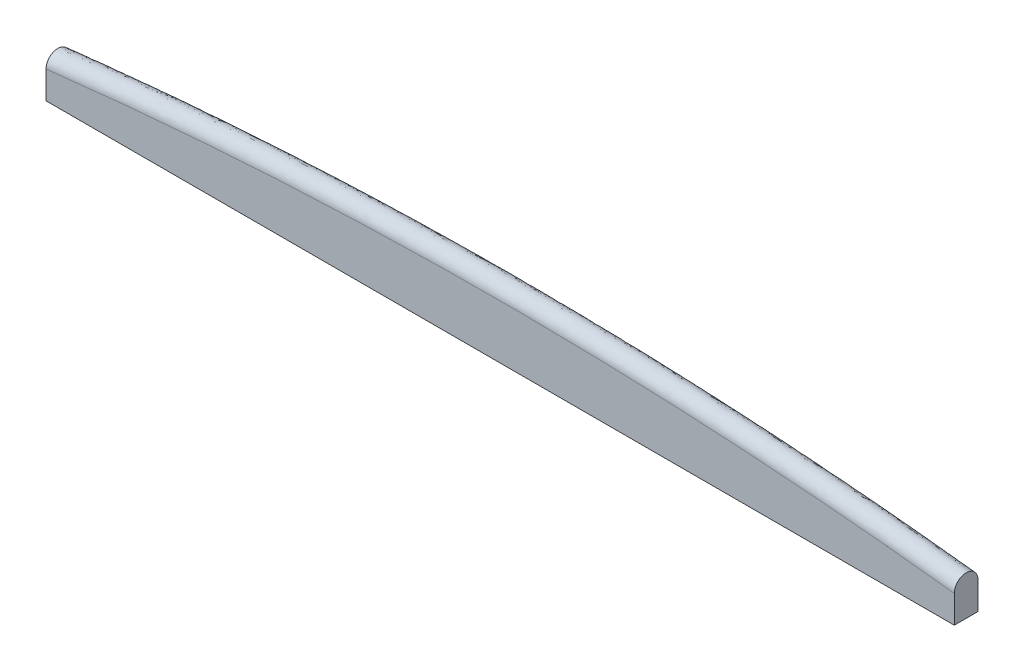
ISO-10303-21;
HEADER;
FILE_DESCRIPTION(('STEP AP214'),'2;1');
FILE_NAME('part.step','',(''),(''),'','','');
FILE_SCHEMA(('AUTOMOTIVE_DESIGN { 1 0 10303 214 1 1 1 1 }'));
ENDSEC;
DATA;
#1=APPLICATION_CONTEXT('core data for automotive mechanical design processes');
#2=APPLICATION_PROTOCOL_DEFINITION('international standard','automotive_design',2000,#1);
#3=PRODUCT_CONTEXT('',#1,'mechanical');
#4=PRODUCT('Part','Part','',(#3));
#5=PRODUCT_RELATED_PRODUCT_CATEGORY('part','',(#4));
#6=PRODUCT_DEFINITION_FORMATION('','',#4);
#7=PRODUCT_DEFINITION_CONTEXT('part definition',#1,'design');
#8=PRODUCT_DEFINITION('design','',#6,#7);
#9=PRODUCT_DEFINITION_SHAPE('','',#8);
#10=(LENGTH_UNIT() NAMED_UNIT(*) SI_UNIT(.MILLI.,.METRE.));
#11=(NAMED_UNIT(*) PLANE_ANGLE_UNIT() SI_UNIT($,.RADIAN.));
#12=(NAMED_UNIT(*) SI_UNIT($,.STERADIAN.) SOLID_ANGLE_UNIT());
#13=UNCERTAINTY_MEASURE_WITH_UNIT(LENGTH_MEASURE(1.E-05),#10,'distance_accuracy_value','');
#14=(GEOMETRIC_REPRESENTATION_CONTEXT(3) GLOBAL_UNCERTAINTY_ASSIGNED_CONTEXT((#13)) GLOBAL_UNIT_ASSIGNED_CONTEXT((#10,
#11,#12)) REPRESENTATION_CONTEXT('',''));
#15=CARTESIAN_POINT('',(0.,0.,0.));
#16=DIRECTION('',(0.,0.,1.));
#17=DIRECTION('',(1.,0.,0.));
#18=AXIS2_PLACEMENT_3D('',#15,#16,#17);
#19=CARTESIAN_POINT('',(35.0360572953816,1.02800792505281,0.762));
#20=CARTESIAN_POINT('',(33.0966421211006,1.29879608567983,0.762));
#21=CARTESIAN_POINT('',(31.15462227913,1.54708569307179,0.762));
#22=CARTESIAN_POINT('',(29.180790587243,1.77628711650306,0.762));
#23=CARTESIAN_POINT('',(29.1515365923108,1.77967893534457,0.762));
#24=CARTESIAN_POINT('',(24.2825245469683,2.3433550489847,0.762));
#25=CARTESIAN_POINT('',(19.4414425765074,2.76264308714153,0.762));
#26=CARTESIAN_POINT('',(9.72870272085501,3.3229719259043,0.762));
#27=CARTESIAN_POINT('',(4.86435346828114,3.46316512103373,0.762));
#28=CARTESIAN_POINT('',(-4.86435346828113,3.46316512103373,0.762));
#29=CARTESIAN_POINT('',(-9.72870272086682,3.32297192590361,0.762));
#30=CARTESIAN_POINT('',(-19.4414425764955,2.76264308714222,0.762));
#31=CARTESIAN_POINT('',(-24.2825245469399,2.34335504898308,0.762));
#32=CARTESIAN_POINT('',(-29.1515365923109,1.77967893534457,0.762));
#33=CARTESIAN_POINT('',(-29.180790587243,1.77628711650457,0.762));
#34=CARTESIAN_POINT('',(-31.1546222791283,1.54708569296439,0.762));
#35=CARTESIAN_POINT('',(-33.0966421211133,1.29879608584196,0.762));
#36=CARTESIAN_POINT('',(-35.0360572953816,1.02800792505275,0.762));
#37=CARTESIAN_POINT('',(35.0944772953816,1.53263759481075,0.762000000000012));
#38=CARTESIAN_POINT('',(33.1550621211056,1.80342575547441,0.762000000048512));
#39=CARTESIAN_POINT('',(31.2130422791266,2.05171536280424,0.761999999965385));
#40=CARTESIAN_POINT('',(29.239210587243,2.28091678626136,0.762000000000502));
#41=CARTESIAN_POINT('',(29.2099859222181,2.28430520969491,0.7620000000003));
#42=CARTESIAN_POINT('',(24.336077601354,2.84854814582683,0.76199999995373));
#43=CARTESIAN_POINT('',(19.4803924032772,3.26924158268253,0.761999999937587));
#44=CARTESIAN_POINT('',(9.74817844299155,3.83069214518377,0.762000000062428));
#45=CARTESIAN_POINT('',(4.874091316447,3.97116512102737,0.76199999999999));
#46=CARTESIAN_POINT('',(-4.874091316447,3.97116512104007,0.76199999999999));
#47=CARTESIAN_POINT('',(-9.74817844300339,3.83069214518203,0.762000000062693));
#48=CARTESIAN_POINT('',(-19.4803924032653,3.26924158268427,0.761999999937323));
#49=CARTESIAN_POINT('',(-24.3360776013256,2.84854814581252,0.761999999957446));
#50=CARTESIAN_POINT('',(-29.2099859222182,2.28430520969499,0.762000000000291));
#51=CARTESIAN_POINT('',(-29.2392105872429,2.28091678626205,0.761999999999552));
#52=CARTESIAN_POINT('',(-31.2130422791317,2.0517153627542,0.762000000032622));
#53=CARTESIAN_POINT('',(-33.1550621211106,1.80342575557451,0.761999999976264));
#54=CARTESIAN_POINT('',(-35.0944772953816,1.53263759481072,0.762000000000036));
#55=CARTESIAN_POINT('',(35.1675022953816,2.16342468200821,0.381000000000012));
#56=CARTESIAN_POINT('',(33.2280871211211,2.43421284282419,0.381000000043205));
#57=CARTESIAN_POINT('',(31.2860672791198,2.68250244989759,0.380999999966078));
#58=CARTESIAN_POINT('',(29.3122355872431,2.91170387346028,0.381000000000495));
#59=CARTESIAN_POINT('',(29.2830475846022,2.91508805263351,0.381000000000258));
#60=CARTESIAN_POINT('',(24.4030189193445,3.48003951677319,0.380999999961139));
#61=CARTESIAN_POINT('',(19.5290796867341,3.90248970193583,0.380999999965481));
#62=CARTESIAN_POINT('',(9.77252309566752,4.46534241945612,0.381000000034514));
#63=CARTESIAN_POINT('',(4.88626362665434,4.60616512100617,0.381000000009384));
#64=CARTESIAN_POINT('',(-4.88626362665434,4.60616512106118,0.380999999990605));
#65=CARTESIAN_POINT('',(-9.77252309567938,4.4653424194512,0.381000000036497));
#66=CARTESIAN_POINT('',(-19.5290796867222,3.90248970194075,0.380999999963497));
#67=CARTESIAN_POINT('',(-24.4030189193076,3.48003951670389,0.38099999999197));
#68=CARTESIAN_POINT('',(-29.2830475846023,2.91508805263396,0.381000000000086));
#69=CARTESIAN_POINT('',(-29.3122355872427,2.91170387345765,0.380999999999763));
#70=CARTESIAN_POINT('',(-31.2860672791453,2.68250245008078,0.381000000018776));
#71=CARTESIAN_POINT('',(-33.2280871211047,2.43421284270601,0.38099999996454));
#72=CARTESIAN_POINT('',(-35.1675022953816,2.16342468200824,0.38100000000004));
#73=CARTESIAN_POINT('',(35.1675022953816,2.16342468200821,-0.381000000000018));
#74=CARTESIAN_POINT('',(33.2280871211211,2.4342128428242,-0.381000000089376));
#75=CARTESIAN_POINT('',(31.2860672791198,2.68250244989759,-0.380999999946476));
#76=CARTESIAN_POINT('',(29.3122355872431,2.91170387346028,-0.381000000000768));
#77=CARTESIAN_POINT('',(29.2830475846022,2.91508805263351,-0.381000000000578));
#78=CARTESIAN_POINT('',(24.4030189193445,3.48003951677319,-0.380999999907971));
#79=CARTESIAN_POINT('',(19.5290796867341,3.90248970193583,-0.380999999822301));
#80=CARTESIAN_POINT('',(9.77252309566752,4.46534241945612,-0.381000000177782));
#81=CARTESIAN_POINT('',(4.88626362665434,4.60616512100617,-0.380999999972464));
#82=CARTESIAN_POINT('',(-4.88626362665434,4.60616512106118,-0.381000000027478));
#83=CARTESIAN_POINT('',(-9.77252309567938,4.4653424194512,-0.381000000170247));
#84=CARTESIAN_POINT('',(-19.5290796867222,3.90248970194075,-0.380999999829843));
#85=CARTESIAN_POINT('',(-24.4030189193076,3.48003951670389,-0.380999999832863));
#86=CARTESIAN_POINT('',(-29.2830475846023,2.91508805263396,-0.381000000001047));
#87=CARTESIAN_POINT('',(-29.3122355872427,2.91170387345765,-0.380999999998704));
#88=CARTESIAN_POINT('',(-31.2860672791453,2.68250245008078,-0.381000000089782));
#89=CARTESIAN_POINT('',(-33.2280871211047,2.43421284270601,-0.380999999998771));
#90=CARTESIAN_POINT('',(-35.1675022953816,2.16342468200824,-0.381000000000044));
#91=CARTESIAN_POINT('',(35.0944772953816,1.53263759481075,-0.762000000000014));
#92=CARTESIAN_POINT('',(33.1550621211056,1.80342575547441,-0.762000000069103));
#93=CARTESIAN_POINT('',(31.2130422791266,2.05171536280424,-0.761999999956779));
#94=CARTESIAN_POINT('',(29.239210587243,2.28091678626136,-0.762000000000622));
#95=CARTESIAN_POINT('',(29.2099859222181,2.28430520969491,-0.762000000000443));
#96=CARTESIAN_POINT('',(24.336077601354,2.84854814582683,-0.761999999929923));
#97=CARTESIAN_POINT('',(19.4803924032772,3.26924158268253,-0.761999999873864));
#98=CARTESIAN_POINT('',(9.74817844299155,3.83069214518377,-0.762000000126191));
#99=CARTESIAN_POINT('',(4.874091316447,3.97116512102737,-0.761999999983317));
#100=CARTESIAN_POINT('',(-4.874091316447,3.97116512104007,-0.762000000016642));
#101=CARTESIAN_POINT('',(-9.74817844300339,3.83069214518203,-0.762000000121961));
#102=CARTESIAN_POINT('',(-19.4803924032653,3.26924158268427,-0.761999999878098));
#103=CARTESIAN_POINT('',(-24.3360776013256,2.84854814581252,-0.76199999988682));
#104=CARTESIAN_POINT('',(-29.2099859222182,2.28430520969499,-0.762000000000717));
#105=CARTESIAN_POINT('',(-29.2392105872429,2.28091678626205,-0.761999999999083));
#106=CARTESIAN_POINT('',(-31.2130422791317,2.0517153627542,-0.762000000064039));
#107=CARTESIAN_POINT('',(-33.1550621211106,1.80342575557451,-0.76199999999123));
#108=CARTESIAN_POINT('',(-35.0944772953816,1.53263759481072,-0.762000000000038));
#109=CARTESIAN_POINT('',(35.0360572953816,1.02800792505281,-0.762));
#110=CARTESIAN_POINT('',(33.0966421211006,1.29879608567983,-0.762));
#111=CARTESIAN_POINT('',(31.15462227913,1.54708569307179,-0.762));
#112=CARTESIAN_POINT('',(29.180790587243,1.77628711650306,-0.762));
#113=CARTESIAN_POINT('',(29.1515365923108,1.77967893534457,-0.762));
#114=CARTESIAN_POINT('',(24.2825245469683,2.3433550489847,-0.762));
#115=CARTESIAN_POINT('',(19.4414425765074,2.76264308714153,-0.762));
#116=CARTESIAN_POINT('',(9.72870272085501,3.3229719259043,-0.762));
#117=CARTESIAN_POINT('',(4.86435346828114,3.46316512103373,-0.762));
#118=CARTESIAN_POINT('',(-4.86435346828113,3.46316512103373,-0.762));
#119=CARTESIAN_POINT('',(-9.72870272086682,3.32297192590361,-0.762));
#120=CARTESIAN_POINT('',(-19.4414425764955,2.76264308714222,-0.762));
#121=CARTESIAN_POINT('',(-24.2825245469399,2.34335504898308,-0.762));
#122=CARTESIAN_POINT('',(-29.1515365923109,1.77967893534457,-0.762));
#123=CARTESIAN_POINT('',(-29.180790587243,1.77628711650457,-0.762));
#124=CARTESIAN_POINT('',(-31.1546222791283,1.54708569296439,-0.762));
#125=CARTESIAN_POINT('',(-33.0966421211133,1.29879608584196,-0.762));
#126=CARTESIAN_POINT('',(-35.0360572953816,1.02800792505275,-0.762));
#127=(BOUNDED_SURFACE() B_SPLINE_SURFACE(5,3,((#19,#20,#21,#22,#23,#24,#25,#26,#27,#28,#29,#30,
#31,#32,#33,#34,#35,#36),(#37,#38,#39,#40,#41,#42,#43,#44,#45,#46,#47,#48,#49,#50,#51,#52,#53,
#54),(#55,#56,#57,#58,#59,#60,#61,#62,#63,#64,#65,#66,#67,#68,#69,#70,#71,#72),(#73,#74,#75,#76,
#77,#78,#79,#80,#81,#82,#83,#84,#85,#86,#87,#88,#89,#90),(#91,#92,#93,#94,#95,#96,#97,#98,#99,
#100,#101,#102,#103,#104,#105,#106,#107,#108),(#109,#110,#111,#112,#113,#114,#115,#116,#117,
#118,#119,#120,#121,#122,#123,#124,#125,#126)),.UNSPECIFIED.,.F.,.F.,
.F.) B_SPLINE_SURFACE_WITH_KNOTS((6,6),(4,2,2,2,2,2,2,2,4),(0.,1.),(-0.101807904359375,
-0.00150658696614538,0.,0.25,0.5,0.75,1.,1.00150658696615,1.10180790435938),
.UNSPECIFIED.) GEOMETRIC_REPRESENTATION_ITEM() RATIONAL_B_SPLINE_SURFACE(((1.,1.,1.,1.,1.,1.,1.,
1.,1.,1.,1.,1.,1.,1.,1.,1.,1.,1.),(0.59999999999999,0.59999999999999,0.600000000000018,
0.600000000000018,0.599999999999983,0.599999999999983,0.599999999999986,0.599999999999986,
0.600000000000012,0.600000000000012,0.599999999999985,0.599999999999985,0.599999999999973,
0.599999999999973,0.599999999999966,0.599999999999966,0.599999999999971,0.599999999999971),
(0.399999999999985,0.399999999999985,0.400000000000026,0.400000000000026,0.399999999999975,
0.399999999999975,0.399999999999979,0.399999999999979,0.400000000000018,0.400000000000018,
0.399999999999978,0.399999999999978,0.39999999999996,0.39999999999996,0.399999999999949,
0.399999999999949,0.399999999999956,0.399999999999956),(0.399999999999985,0.399999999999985,
0.400000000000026,0.400000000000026,0.399999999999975,0.399999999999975,0.399999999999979,
0.399999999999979,0.400000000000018,0.400000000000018,0.399999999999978,0.399999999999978,
0.39999999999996,0.39999999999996,0.399999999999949,0.399999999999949,0.399999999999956,
0.399999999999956),(0.59999999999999,0.59999999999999,0.600000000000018,0.600000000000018,
0.599999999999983,0.599999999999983,0.599999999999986,0.599999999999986,0.600000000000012,
0.600000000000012,0.599999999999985,0.599999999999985,0.599999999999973,0.599999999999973,
0.599999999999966,0.599999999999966,0.599999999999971,0.599999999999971),(1.,1.,1.,1.,1.,1.,1.,
1.,1.,1.,1.,1.,1.,1.,1.,1.,1.,1.))) REPRESENTATION_ITEM('') SURFACE());
#128=CARTESIAN_POINT('',(-35.0360572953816,1.02800792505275,0.762));
#129=CARTESIAN_POINT('',(-33.0966421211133,1.29879608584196,0.762));
#130=CARTESIAN_POINT('',(-31.1546222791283,1.54708569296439,0.762));
#131=CARTESIAN_POINT('',(-29.180790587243,1.77628711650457,0.762));
#132=CARTESIAN_POINT('',(-29.1515365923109,1.77967893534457,0.762));
#133=CARTESIAN_POINT('',(-24.2825245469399,2.34335504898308,0.762));
#134=CARTESIAN_POINT('',(-19.4414425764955,2.76264308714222,0.762));
#135=CARTESIAN_POINT('',(-9.72870272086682,3.32297192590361,0.762));
#136=CARTESIAN_POINT('',(-4.86435346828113,3.46316512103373,0.762));
#137=CARTESIAN_POINT('',(4.86435346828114,3.46316512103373,0.762));
#138=CARTESIAN_POINT('',(9.72870272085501,3.3229719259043,0.762));
#139=CARTESIAN_POINT('',(19.4414425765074,2.76264308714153,0.762));
#140=CARTESIAN_POINT('',(24.2825245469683,2.3433550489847,0.762));
#141=CARTESIAN_POINT('',(29.1515365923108,1.77967893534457,0.762));
#142=CARTESIAN_POINT('',(29.180790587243,1.77628711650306,0.762));
#143=CARTESIAN_POINT('',(31.15462227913,1.54708569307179,0.762));
#144=CARTESIAN_POINT('',(33.0966421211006,1.29879608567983,0.762));
#145=CARTESIAN_POINT('',(35.0360572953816,1.02800792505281,0.762));
#146=(BOUNDED_CURVE() B_SPLINE_CURVE(3,(#128,#129,#130,#131,#132,#133,#134,#135,#136,#137,#138,
#139,#140,#141,#142,#143,#144,#145),.UNSPECIFIED.,.F.,.F.) B_SPLINE_CURVE_WITH_KNOTS((4,2,2,2,2,
2,2,2,4),(-0.101807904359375,-0.00150658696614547,0.,0.250000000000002,0.500000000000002,
0.750000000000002,1.,1.00150658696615,1.10180790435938),
.UNSPECIFIED.) CURVE() GEOMETRIC_REPRESENTATION_ITEM() RATIONAL_B_SPLINE_CURVE((1.,1.,1.,1.,1.,
1.,1.,1.,1.,1.,1.,1.,1.,1.,1.,1.,1.,1.)) REPRESENTATION_ITEM(''));
#147=CARTESIAN_POINT('',(29.21,1.7728953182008,0.762));
#148=VERTEX_POINT('',#147);
#149=CARTESIAN_POINT('',(-29.21,1.77289531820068,0.762));
#150=VERTEX_POINT('',#149);
#151=EDGE_CURVE('E81',#148,#150,#146,.F.);
#152=CARTESIAN_POINT('',(29.21,1.77289531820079,0.762));
#153=CARTESIAN_POINT('',(29.2099460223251,1.77545632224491,0.761999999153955));
#154=CARTESIAN_POINT('',(29.2098920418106,1.77801737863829,0.761987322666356));
#155=CARTESIAN_POINT('',(29.2096849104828,1.78792696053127,0.761889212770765));
#156=CARTESIAN_POINT('',(29.209535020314,1.79527487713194,0.76171206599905));
#157=CARTESIAN_POINT('',(29.2092966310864,1.80819902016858,0.761216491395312));
#158=CARTESIAN_POINT('',(29.2092020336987,1.81377690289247,0.760942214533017));
#159=CARTESIAN_POINT('',(29.2090041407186,1.82629231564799,0.760191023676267));
#160=CARTESIAN_POINT('',(29.2089043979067,1.83322794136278,0.759680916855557));
#161=CARTESIAN_POINT('',(29.2087057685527,1.84854332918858,0.758346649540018));
#162=CARTESIAN_POINT('',(29.2086114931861,1.85691937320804,0.75747895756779));
#163=CARTESIAN_POINT('',(29.2084335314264,1.87521169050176,0.75528127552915));
#164=CARTESIAN_POINT('',(29.2083551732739,1.88512129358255,0.753895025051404));
#165=CARTESIAN_POINT('',(29.2082199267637,1.90658366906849,0.750465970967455));
#166=CARTESIAN_POINT('',(29.2081690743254,1.91812498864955,0.748351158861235));
#167=CARTESIAN_POINT('',(29.208099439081,1.94295421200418,0.743212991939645));
#168=CARTESIAN_POINT('',(29.2080871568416,1.95622337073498,0.740098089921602));
#169=CARTESIAN_POINT('',(29.208099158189,1.97673219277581,0.734705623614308));
#170=CARTESIAN_POINT('',(29.2081096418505,1.98403626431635,0.732669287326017));
#171=CARTESIAN_POINT('',(29.2081424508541,1.99910725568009,0.728226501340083));
#172=CARTESIAN_POINT('',(29.2081655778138,2.00686944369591,0.725803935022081));
#173=CARTESIAN_POINT('',(29.2082241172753,2.02286091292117,0.720533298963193));
#174=CARTESIAN_POINT('',(29.2082602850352,2.03108425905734,0.717667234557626));
#175=CARTESIAN_POINT('',(29.2083448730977,2.04799850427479,0.711447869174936));
#176=CARTESIAN_POINT('',(29.2083939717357,2.05668203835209,0.708074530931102));
#177=CARTESIAN_POINT('',(29.2085037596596,2.07451155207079,0.700772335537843));
#178=CARTESIAN_POINT('',(29.2085650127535,2.08364842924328,0.696821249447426));
#179=CARTESIAN_POINT('',(29.2086976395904,2.10237254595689,0.688288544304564));
#180=CARTESIAN_POINT('',(29.2087694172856,2.11194860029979,0.683682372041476));
#181=CARTESIAN_POINT('',(29.2089206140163,2.13153014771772,0.673757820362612));
#182=CARTESIAN_POINT('',(29.2090002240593,2.14152197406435,0.66841246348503));
#183=CARTESIAN_POINT('',(29.2091633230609,2.16190322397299,0.656921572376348));
#184=CARTESIAN_POINT('',(29.2092467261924,2.17227605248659,0.650746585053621));
#185=CARTESIAN_POINT('',(29.2094122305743,2.19337414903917,0.637502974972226));
#186=CARTESIAN_POINT('',(29.2094939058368,2.20407940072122,0.630402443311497));
#187=CARTESIAN_POINT('',(29.2096485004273,2.22578140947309,0.615210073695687));
#188=CARTESIAN_POINT('',(29.2097205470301,2.23675421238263,0.607083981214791));
#189=CARTESIAN_POINT('',(29.2098481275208,2.25891135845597,0.589740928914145));
#190=CARTESIAN_POINT('',(29.2099023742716,2.27006724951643,0.58048761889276));
#191=CARTESIAN_POINT('',(29.2099766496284,2.29249097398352,0.560790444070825));
#192=CARTESIAN_POINT('',(29.2099944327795,2.30372545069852,0.550308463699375));
#193=CARTESIAN_POINT('',(29.2100023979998,2.31933169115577,0.534844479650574));
#194=CARTESIAN_POINT('',(29.2100025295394,2.32396948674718,0.530128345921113));
#195=CARTESIAN_POINT('',(29.2100080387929,2.33312498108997,0.520572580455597));
#196=CARTESIAN_POINT('',(29.2100134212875,2.33764256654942,0.515732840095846));
#197=CARTESIAN_POINT('',(29.2100326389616,2.3510078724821,0.501035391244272));
#198=CARTESIAN_POINT('',(29.2100495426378,2.35966469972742,0.491002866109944));
#199=CARTESIAN_POINT('',(29.2100889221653,2.37643548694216,0.47051051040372));
#200=CARTESIAN_POINT('',(29.2101113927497,2.38454995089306,0.460051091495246));
#201=CARTESIAN_POINT('',(29.2101573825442,2.4002012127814,0.438753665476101));
#202=CARTESIAN_POINT('',(29.2101808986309,2.40773956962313,0.427916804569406));
#203=CARTESIAN_POINT('',(29.2102258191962,2.42220897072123,0.405917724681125));
#204=CARTESIAN_POINT('',(29.2102472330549,2.42914269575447,0.394757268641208));
#205=CARTESIAN_POINT('',(29.2102853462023,2.4423797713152,0.372166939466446));
#206=CARTESIAN_POINT('',(29.2103020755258,2.44868696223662,0.360739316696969));
#207=CARTESIAN_POINT('',(29.2103290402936,2.46065454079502,0.337672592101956));
#208=CARTESIAN_POINT('',(29.2103393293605,2.46631993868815,0.326036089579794));
#209=CARTESIAN_POINT('',(29.210352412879,2.4769943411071,0.302610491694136));
#210=CARTESIAN_POINT('',(29.210355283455,2.48200950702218,0.290824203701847));
#211=CARTESIAN_POINT('',(29.2103533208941,2.49138064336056,0.267157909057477));
#212=CARTESIAN_POINT('',(29.2103485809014,2.49574388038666,0.255280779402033));
#213=CARTESIAN_POINT('',(29.2103319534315,2.50381495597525,0.231490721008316));
#214=CARTESIAN_POINT('',(29.2103201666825,2.50753109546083,0.219580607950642));
#215=CARTESIAN_POINT('',(29.2102907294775,2.51431803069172,0.195780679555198));
#216=CARTESIAN_POINT('',(29.2102731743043,2.51739806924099,0.183893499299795));
#217=CARTESIAN_POINT('',(29.2102341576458,2.52292864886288,0.160192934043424));
#218=CARTESIAN_POINT('',(29.2102127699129,2.52538926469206,0.148381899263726));
#219=CARTESIAN_POINT('',(29.2101686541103,2.52970206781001,0.124883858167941));
#220=CARTESIAN_POINT('',(29.2101459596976,2.53156503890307,0.11319883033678));
#221=CARTESIAN_POINT('',(29.2101023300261,2.53470819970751,0.0899992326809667));
#222=CARTESIAN_POINT('',(29.2100813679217,2.53599975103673,0.0784862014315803));
#223=CARTESIAN_POINT('',(29.2100447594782,2.53802960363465,0.0556728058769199));
#224=CARTESIAN_POINT('',(29.210029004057,2.53877970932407,0.0443734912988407));
#225=CARTESIAN_POINT('',(29.2100067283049,2.53975937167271,0.0220252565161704));
#226=CARTESIAN_POINT('',(29.2099999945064,2.54000104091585,0.0109768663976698));
#227=CARTESIAN_POINT('',(29.210000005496,2.53999895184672,-0.0111249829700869));
#228=CARTESIAN_POINT('',(29.2100067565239,2.53975496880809,-0.0221784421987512));
#229=CARTESIAN_POINT('',(29.2100291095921,2.53877013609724,-0.0445375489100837));
#230=CARTESIAN_POINT('',(29.2100449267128,2.53801712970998,-0.0558426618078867));
#231=CARTESIAN_POINT('',(29.2100816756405,2.53598081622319,-0.0786683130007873));
#232=CARTESIAN_POINT('',(29.2101027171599,2.53468566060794,-0.0901877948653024));
#233=CARTESIAN_POINT('',(29.210146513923,2.53153451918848,-0.113400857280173));
#234=CARTESIAN_POINT('',(29.2101692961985,2.52966712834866,-0.125092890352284));
#235=CARTESIAN_POINT('',(29.2102135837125,2.52534461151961,-0.148605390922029));
#236=CARTESIAN_POINT('',(29.2102350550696,2.52287865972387,-0.160423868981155));
#237=CARTESIAN_POINT('',(29.2102742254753,2.51733644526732,-0.184139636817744));
#238=CARTESIAN_POINT('',(29.2102918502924,2.51425006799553,-0.196034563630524));
#239=CARTESIAN_POINT('',(29.2103214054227,2.50744942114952,-0.219850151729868));
#240=CARTESIAN_POINT('',(29.2103332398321,2.50372587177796,-0.231768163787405));
#241=CARTESIAN_POINT('',(29.2103499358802,2.49563889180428,-0.255574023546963));
#242=CARTESIAN_POINT('',(29.2103546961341,2.49126712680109,-0.267459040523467));
#243=CARTESIAN_POINT('',(29.2103566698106,2.48187782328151,-0.291140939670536));
#244=CARTESIAN_POINT('',(29.2103537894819,2.47685298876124,-0.302934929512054));
#245=CARTESIAN_POINT('',(29.2103406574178,2.46615813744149,-0.326375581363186));
#246=CARTESIAN_POINT('',(29.2103303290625,2.46048193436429,-0.338019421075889));
#247=CARTESIAN_POINT('',(29.2103032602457,2.44849166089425,-0.361100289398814));
#248=CARTESIAN_POINT('',(29.2102864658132,2.44217256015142,-0.372534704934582));
#249=CARTESIAN_POINT('',(29.2102482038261,2.42891063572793,-0.395137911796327));
#250=CARTESIAN_POINT('',(29.2102267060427,2.42196395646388,-0.406304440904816));
#251=CARTESIAN_POINT('',(29.2101816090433,2.40746770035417,-0.428314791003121));
#252=CARTESIAN_POINT('',(29.2101580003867,2.39991543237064,-0.439156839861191));
#253=CARTESIAN_POINT('',(29.2101118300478,2.38423551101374,-0.460463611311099));
#254=CARTESIAN_POINT('',(29.2100892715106,2.37610629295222,-0.470927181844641));
#255=CARTESIAN_POINT('',(29.2100497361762,2.35930528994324,-0.491426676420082));
#256=CARTESIAN_POINT('',(29.2100327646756,2.3506329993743,-0.501462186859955));
#257=CARTESIAN_POINT('',(29.2100134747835,2.33724406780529,-0.516163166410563));
#258=CARTESIAN_POINT('',(29.2100080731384,2.33271854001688,-0.521003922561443));
#259=CARTESIAN_POINT('',(29.2100025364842,2.3235470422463,-0.530561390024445));
#260=CARTESIAN_POINT('',(29.2100023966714,2.31890118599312,-0.535278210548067));
#261=CARTESIAN_POINT('',(29.2099944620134,2.30331931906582,-0.550693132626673));
#262=CARTESIAN_POINT('',(29.2099768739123,2.29212007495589,-0.561127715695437));
#263=CARTESIAN_POINT('',(29.2099033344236,2.26976783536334,-0.580739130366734));
#264=CARTESIAN_POINT('',(29.2098496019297,2.25864783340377,-0.5899537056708));
#265=CARTESIAN_POINT('',(29.2097232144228,2.23656225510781,-0.607227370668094));
#266=CARTESIAN_POINT('',(29.2096518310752,2.22562483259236,-0.615322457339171));
#267=CARTESIAN_POINT('',(29.2094986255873,2.20399241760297,-0.630459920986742));
#268=CARTESIAN_POINT('',(29.2094176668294,2.19332113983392,-0.637536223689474));
#269=CARTESIAN_POINT('',(29.209253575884,2.17228913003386,-0.650737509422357));
#270=CARTESIAN_POINT('',(29.2091708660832,2.16194822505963,-0.656894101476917));
#271=CARTESIAN_POINT('',(29.2090090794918,2.14162847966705,-0.6683534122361));
#272=CARTESIAN_POINT('',(29.2089300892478,2.13166608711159,-0.673685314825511));
#273=CARTESIAN_POINT('',(29.2087800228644,2.11214075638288,-0.683587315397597));
#274=CARTESIAN_POINT('',(29.2087087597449,2.10259137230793,-0.68818415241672));
#275=CARTESIAN_POINT('',(29.2085770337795,2.08391777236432,-0.696701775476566));
#276=CARTESIAN_POINT('',(29.2085161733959,2.0748046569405,-0.700646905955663));
#277=CARTESIAN_POINT('',(29.2084070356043,2.05701977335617,-0.707940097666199));
#278=CARTESIAN_POINT('',(29.2083582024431,2.04835704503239,-0.711310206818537));
#279=CARTESIAN_POINT('',(29.2082740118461,2.0314815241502,-0.717525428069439));
#280=CARTESIAN_POINT('',(29.2082379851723,2.02327605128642,-0.720390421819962));
#281=CARTESIAN_POINT('',(29.20817960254,2.00731750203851,-0.725660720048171));
#282=CARTESIAN_POINT('',(29.2081565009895,1.99957032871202,-0.728083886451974));
#283=CARTESIAN_POINT('',(29.2081236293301,1.98452663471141,-0.73252924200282));
#284=CARTESIAN_POINT('',(29.2081130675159,1.97723482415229,-0.734567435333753));
#285=CARTESIAN_POINT('',(29.2081006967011,1.95675510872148,-0.739967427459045));
#286=CARTESIAN_POINT('',(29.208112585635,1.94350274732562,-0.74308848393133));
#287=CARTESIAN_POINT('',(29.208181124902,1.91869771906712,-0.74824106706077));
#288=CARTESIAN_POINT('',(29.2082313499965,1.9071637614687,-0.750363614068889));
#289=CARTESIAN_POINT('',(29.2083651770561,1.88570771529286,-0.753808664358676));
#290=CARTESIAN_POINT('',(29.2084428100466,1.87579708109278,-0.75520282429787));
#291=CARTESIAN_POINT('',(29.2086192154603,1.8574951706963,-0.757415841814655));
#292=CARTESIAN_POINT('',(29.2087127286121,1.84911058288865,-0.758290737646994));
#293=CARTESIAN_POINT('',(29.2089099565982,1.83377125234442,-0.759638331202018));
#294=CARTESIAN_POINT('',(29.2090091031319,1.8268202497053,-0.760154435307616));
#295=CARTESIAN_POINT('',(29.2092055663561,1.81426768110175,-0.760916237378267));
#296=CARTESIAN_POINT('',(29.2092994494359,1.8086680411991,-0.76119507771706));
#297=CARTESIAN_POINT('',(29.2095375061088,1.79566033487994,-0.761701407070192));
#298=CARTESIAN_POINT('',(29.2096881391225,1.78825053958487,-0.761883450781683));
#299=CARTESIAN_POINT('',(29.2098928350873,1.7781917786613,-0.761986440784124));
#300=CARTESIAN_POINT('',(29.2099467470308,1.77554352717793,-0.761999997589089));
#301=CARTESIAN_POINT('',(29.21,1.7728953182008,-0.762));
#302=B_SPLINE_CURVE_WITH_KNOTS('',3,(#152,#153,#154,#155,#156,#157,#158,#159,#160,#161,#162,
#163,#164,#165,#166,#167,#168,#169,#170,#171,#172,#173,#174,#175,#176,#177,#178,#179,#180,#181,
#182,#183,#184,#185,#186,#187,#188,#189,#190,#191,#192,#193,#194,#195,#196,#197,#198,#199,#200,
#201,#202,#203,#204,#205,#206,#207,#208,#209,#210,#211,#212,#213,#214,#215,#216,#217,#218,#219,
#220,#221,#222,#223,#224,#225,#226,#227,#228,#229,#230,#231,#232,#233,#234,#235,#236,#237,#238,
#239,#240,#241,#242,#243,#244,#245,#246,#247,#248,#249,#250,#251,#252,#253,#254,#255,#256,#257,
#258,#259,#260,#261,#262,#263,#264,#265,#266,#267,#268,#269,#270,#271,#272,#273,#274,#275,#276,
#277,#278,#279,#280,#281,#282,#283,#284,#285,#286,#287,#288,#289,#290,#291,#292,#293,#294,#295,
#296,#297,#298,#299,#300,#301),.UNSPECIFIED.,.F.,.F.,(4,2,2,2,2,2,2,2,2,2,2,2,2,2,2,2,2,2,2,2,2,
2,2,2,2,2,2,2,2,2,2,2,2,2,2,2,2,2,2,2,2,2,2,2,2,2,2,2,2,2,2,2,2,2,2,2,2,2,2,2,2,2,2,2,2,2,2,2,2,
2,2,2,2,2,4),(0.,0.00768482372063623,0.0297361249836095,0.0464912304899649,0.0673538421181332,
0.0926135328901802,0.122625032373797,0.157813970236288,0.198682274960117,0.221427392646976,
0.245817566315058,0.271938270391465,0.2998797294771,0.329736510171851,0.361606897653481,
0.395592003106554,0.431794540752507,0.47031720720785,0.511260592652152,0.554720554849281,
0.600784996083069,0.620626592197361,0.640486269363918,0.680220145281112,0.719916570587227,
0.759501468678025,0.798900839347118,0.838041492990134,0.876851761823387,0.915262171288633,
0.953206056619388,0.990620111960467,1.02744486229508,1.06362505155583,1.09910994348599,
1.13385353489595,1.16781468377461,1.20095715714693,1.2341149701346,1.2680940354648,
1.30285804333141,1.33836575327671,1.37457104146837,1.41142302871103,1.44886629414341,
1.48684117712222,1.52528416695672,1.56412837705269,1.60330409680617,1.64273941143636,
1.68236087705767,1.72209423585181,1.76186515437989,1.78174331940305,1.80160333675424,
1.84749386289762,1.8907970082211,1.93159993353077,1.96999763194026,2.00608975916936,
2.0399780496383,2.07176425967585,2.10154857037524,2.12942838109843,2.15549742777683,
2.17984516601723,2.20255636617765,2.24337991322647,2.27855132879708,2.30856916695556,
2.33385654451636,2.35476644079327,2.37158735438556,2.39382452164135,2.40177086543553),.UNSPECIFIED.);
#303=CARTESIAN_POINT('',(29.21,1.7728953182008,-0.762));
#304=VERTEX_POINT('',#303);
#305=EDGE_CURVE('E44',#304,#148,#302,.F.);
#306=CARTESIAN_POINT('',(35.0360572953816,1.02800792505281,-0.762));
#307=CARTESIAN_POINT('',(33.0966421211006,1.29879608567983,-0.762));
#308=CARTESIAN_POINT('',(31.15462227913,1.54708569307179,-0.762));
#309=CARTESIAN_POINT('',(29.180790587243,1.77628711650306,-0.762));
#310=CARTESIAN_POINT('',(29.1515365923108,1.77967893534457,-0.762));
#311=CARTESIAN_POINT('',(24.2825245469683,2.3433550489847,-0.762));
#312=CARTESIAN_POINT('',(19.4414425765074,2.76264308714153,-0.762));
#313=CARTESIAN_POINT('',(9.72870272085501,3.3229719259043,-0.762));
#314=CARTESIAN_POINT('',(4.86435346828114,3.46316512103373,-0.762));
#315=CARTESIAN_POINT('',(-4.86435346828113,3.46316512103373,-0.762));
#316=CARTESIAN_POINT('',(-9.72870272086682,3.32297192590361,-0.762));
#317=CARTESIAN_POINT('',(-19.4414425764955,2.76264308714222,-0.762));
#318=CARTESIAN_POINT('',(-24.2825245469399,2.34335504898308,-0.762));
#319=CARTESIAN_POINT('',(-29.1515365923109,1.77967893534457,-0.762));
#320=CARTESIAN_POINT('',(-29.180790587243,1.77628711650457,-0.762));
#321=CARTESIAN_POINT('',(-31.1546222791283,1.54708569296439,-0.762));
#322=CARTESIAN_POINT('',(-33.0966421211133,1.29879608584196,-0.762));
#323=CARTESIAN_POINT('',(-35.0360572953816,1.02800792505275,-0.762));
#324=(BOUNDED_CURVE() B_SPLINE_CURVE(3,(#306,#307,#308,#309,#310,#311,#312,#313,#314,#315,#316,
#317,#318,#319,#320,#321,#322,#323),.UNSPECIFIED.,.F.,.F.) B_SPLINE_CURVE_WITH_KNOTS((4,2,2,2,2,
2,2,2,4),(-0.101807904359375,-0.00150658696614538,0.,0.25,0.5,0.75,1.,1.00150658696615,
1.10180790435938),
.UNSPECIFIED.) CURVE() GEOMETRIC_REPRESENTATION_ITEM() RATIONAL_B_SPLINE_CURVE((1.,1.,1.,1.,1.,
1.,1.,1.,1.,1.,1.,1.,1.,1.,1.,1.,1.,1.)) REPRESENTATION_ITEM(''));
#325=CARTESIAN_POINT('',(-29.21,1.77289531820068,-0.762));
#326=VERTEX_POINT('',#325);
#327=EDGE_CURVE('E100',#326,#304,#324,.F.);
#328=CARTESIAN_POINT('',(-29.21,1.77289531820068,-0.762));
#329=CARTESIAN_POINT('',(-29.2099460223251,1.77545632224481,-0.761999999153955));
#330=CARTESIAN_POINT('',(-29.2098920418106,1.7780173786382,-0.761987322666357));
#331=CARTESIAN_POINT('',(-29.2096849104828,1.78792696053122,-0.761889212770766));
#332=CARTESIAN_POINT('',(-29.2095350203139,1.79527487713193,-0.761712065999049));
#333=CARTESIAN_POINT('',(-29.2092966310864,1.80819902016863,-0.761216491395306));
#334=CARTESIAN_POINT('',(-29.2092020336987,1.81377690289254,-0.760942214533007));
#335=CARTESIAN_POINT('',(-29.2090041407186,1.82629231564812,-0.760191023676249));
#336=CARTESIAN_POINT('',(-29.2089043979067,1.83322794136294,-0.759680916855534));
#337=CARTESIAN_POINT('',(-29.2087057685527,1.84854332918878,-0.758346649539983));
#338=CARTESIAN_POINT('',(-29.2086114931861,1.85691937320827,-0.757478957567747));
#339=CARTESIAN_POINT('',(-29.2084335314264,1.87521169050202,-0.75528127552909));
#340=CARTESIAN_POINT('',(-29.2083551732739,1.88512129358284,-0.753895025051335));
#341=CARTESIAN_POINT('',(-29.2082199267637,1.9065836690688,-0.750465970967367));
#342=CARTESIAN_POINT('',(-29.2081690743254,1.91812498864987,-0.748351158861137));
#343=CARTESIAN_POINT('',(-29.208099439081,1.94295421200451,-0.743212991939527));
#344=CARTESIAN_POINT('',(-29.2080871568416,1.95622337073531,-0.740098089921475));
#345=CARTESIAN_POINT('',(-29.208099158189,1.97673219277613,-0.734705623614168));
#346=CARTESIAN_POINT('',(-29.2081096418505,1.98403626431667,-0.732669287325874));
#347=CARTESIAN_POINT('',(-29.2081424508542,1.9991072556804,-0.728226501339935));
#348=CARTESIAN_POINT('',(-29.2081655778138,2.00686944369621,-0.72580393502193));
#349=CARTESIAN_POINT('',(-29.2082241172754,2.02286091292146,-0.720533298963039));
#350=CARTESIAN_POINT('',(-29.2082602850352,2.03108425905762,-0.717667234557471));
#351=CARTESIAN_POINT('',(-29.2083448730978,2.04799850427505,-0.711447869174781));
#352=CARTESIAN_POINT('',(-29.2083939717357,2.05668203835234,-0.708074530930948));
#353=CARTESIAN_POINT('',(-29.2085037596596,2.07451155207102,-0.700772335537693));
#354=CARTESIAN_POINT('',(-29.2085650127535,2.0836484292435,-0.69682124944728));
#355=CARTESIAN_POINT('',(-29.2086976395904,2.10237254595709,-0.688288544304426));
#356=CARTESIAN_POINT('',(-29.2087694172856,2.11194860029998,-0.683682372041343));
#357=CARTESIAN_POINT('',(-29.2089206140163,2.13153014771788,-0.673757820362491));
#358=CARTESIAN_POINT('',(-29.2090002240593,2.1415219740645,-0.668412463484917));
#359=CARTESIAN_POINT('',(-29.2091633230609,2.16190322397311,-0.656921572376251));
#360=CARTESIAN_POINT('',(-29.2092467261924,2.1722760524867,-0.650746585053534));
#361=CARTESIAN_POINT('',(-29.2094122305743,2.19337414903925,-0.63750297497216));
#362=CARTESIAN_POINT('',(-29.2094939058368,2.2040794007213,-0.630402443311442));
#363=CARTESIAN_POINT('',(-29.2096485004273,2.22578140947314,-0.615210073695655));
#364=CARTESIAN_POINT('',(-29.2097205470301,2.23675421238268,-0.607083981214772));
#365=CARTESIAN_POINT('',(-29.2098481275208,2.25891135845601,-0.589740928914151));
#366=CARTESIAN_POINT('',(-29.2099023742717,2.27006724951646,-0.580487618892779));
#367=CARTESIAN_POINT('',(-29.2099766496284,2.29249097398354,-0.560790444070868));
#368=CARTESIAN_POINT('',(-29.2099944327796,2.30372545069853,-0.550308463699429));
#369=CARTESIAN_POINT('',(-29.2100023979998,2.31933169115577,-0.534844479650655));
#370=CARTESIAN_POINT('',(-29.2100025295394,2.32396948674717,-0.53012834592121));
#371=CARTESIAN_POINT('',(-29.2100080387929,2.33312498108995,-0.520572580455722));
#372=CARTESIAN_POINT('',(-29.2100134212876,2.33764256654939,-0.515732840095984));
#373=CARTESIAN_POINT('',(-29.2100326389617,2.35100787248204,-0.50103539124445));
#374=CARTESIAN_POINT('',(-29.2100495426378,2.35966469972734,-0.491002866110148));
#375=CARTESIAN_POINT('',(-29.2100889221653,2.37643548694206,-0.470510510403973));
#376=CARTESIAN_POINT('',(-29.2101113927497,2.38454995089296,-0.460051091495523));
#377=CARTESIAN_POINT('',(-29.2101573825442,2.40020121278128,-0.43875366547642));
#378=CARTESIAN_POINT('',(-29.2101808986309,2.407739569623,-0.427916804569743));
#379=CARTESIAN_POINT('',(-29.2102258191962,2.4222089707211,-0.405917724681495));
#380=CARTESIAN_POINT('',(-29.210247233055,2.42914269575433,-0.394757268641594));
#381=CARTESIAN_POINT('',(-29.2102853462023,2.44237977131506,-0.372166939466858));
#382=CARTESIAN_POINT('',(-29.2103020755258,2.44868696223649,-0.360739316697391));
#383=CARTESIAN_POINT('',(-29.2103290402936,2.46065454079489,-0.337672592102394));
#384=CARTESIAN_POINT('',(-29.2103393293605,2.46631993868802,-0.326036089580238));
#385=CARTESIAN_POINT('',(-29.210352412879,2.47699434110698,-0.302610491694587));
#386=CARTESIAN_POINT('',(-29.210355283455,2.48200950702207,-0.2908242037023));
#387=CARTESIAN_POINT('',(-29.2103533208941,2.49138064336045,-0.267157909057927));
#388=CARTESIAN_POINT('',(-29.2103485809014,2.49574388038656,-0.255280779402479));
#389=CARTESIAN_POINT('',(-29.2103319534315,2.50381495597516,-0.23149072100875));
#390=CARTESIAN_POINT('',(-29.2103201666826,2.50753109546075,-0.219580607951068));
#391=CARTESIAN_POINT('',(-29.2102907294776,2.51431803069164,-0.195780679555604));
#392=CARTESIAN_POINT('',(-29.2102731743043,2.51739806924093,-0.183893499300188));
#393=CARTESIAN_POINT('',(-29.2102341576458,2.52292864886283,-0.160192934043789));
#394=CARTESIAN_POINT('',(-29.2102127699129,2.52538926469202,-0.148381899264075));
#395=CARTESIAN_POINT('',(-29.2101686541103,2.52970206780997,-0.124883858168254));
#396=CARTESIAN_POINT('',(-29.2101459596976,2.53156503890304,-0.113198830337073));
#397=CARTESIAN_POINT('',(-29.2101023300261,2.53470819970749,-0.0899992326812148));
#398=CARTESIAN_POINT('',(-29.2100813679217,2.53599975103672,-0.0784862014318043));
#399=CARTESIAN_POINT('',(-29.2100447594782,2.53802960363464,-0.0556728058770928));
#400=CARTESIAN_POINT('',(-29.210029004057,2.53877970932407,-0.0443734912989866));
#401=CARTESIAN_POINT('',(-29.2100067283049,2.53975937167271,-0.0220252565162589));
#402=CARTESIAN_POINT('',(-29.2099999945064,2.54000104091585,-0.010976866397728));
#403=CARTESIAN_POINT('',(-29.210000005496,2.53999895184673,0.0111249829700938));
#404=CARTESIAN_POINT('',(-29.2100067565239,2.53975496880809,0.0221784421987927));
#405=CARTESIAN_POINT('',(-29.2100291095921,2.53877013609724,0.0445375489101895));
#406=CARTESIAN_POINT('',(-29.2100449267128,2.53801712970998,0.0558426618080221));
#407=CARTESIAN_POINT('',(-29.2100816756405,2.53598081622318,0.0786683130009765));
#408=CARTESIAN_POINT('',(-29.2101027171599,2.53468566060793,0.0901877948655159));
#409=CARTESIAN_POINT('',(-29.210146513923,2.53153451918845,0.11340085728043));
#410=CARTESIAN_POINT('',(-29.2101692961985,2.52966712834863,0.125092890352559));
#411=CARTESIAN_POINT('',(-29.2102135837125,2.52534461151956,0.148605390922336));
#412=CARTESIAN_POINT('',(-29.2102350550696,2.52287865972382,0.160423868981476));
#413=CARTESIAN_POINT('',(-29.2102742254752,2.51733644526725,0.184139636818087));
#414=CARTESIAN_POINT('',(-29.2102918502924,2.51425006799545,0.196034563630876));
#415=CARTESIAN_POINT('',(-29.2103214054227,2.50744942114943,0.219850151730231));
#416=CARTESIAN_POINT('',(-29.2103332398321,2.50372587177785,0.231768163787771));
#417=CARTESIAN_POINT('',(-29.2103499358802,2.49563889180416,0.25557402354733));
#418=CARTESIAN_POINT('',(-29.2103546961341,2.49126712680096,0.267459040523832));
#419=CARTESIAN_POINT('',(-29.2103566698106,2.48187782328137,0.291140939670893));
#420=CARTESIAN_POINT('',(-29.2103537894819,2.4768529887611,0.302934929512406));
#421=CARTESIAN_POINT('',(-29.2103406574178,2.46615813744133,0.326375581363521));
#422=CARTESIAN_POINT('',(-29.2103303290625,2.46048193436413,0.338019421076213));
#423=CARTESIAN_POINT('',(-29.2103032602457,2.44849166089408,0.361100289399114));
#424=CARTESIAN_POINT('',(-29.2102864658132,2.44217256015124,0.372534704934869));
#425=CARTESIAN_POINT('',(-29.2102482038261,2.42891063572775,0.395137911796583));
#426=CARTESIAN_POINT('',(-29.2102267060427,2.4219639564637,0.406304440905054));
#427=CARTESIAN_POINT('',(-29.2101816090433,2.40746770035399,0.428314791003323));
#428=CARTESIAN_POINT('',(-29.2101580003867,2.39991543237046,0.439156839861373));
#429=CARTESIAN_POINT('',(-29.2101118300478,2.38423551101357,0.46046361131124));
#430=CARTESIAN_POINT('',(-29.2100892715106,2.37610629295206,0.470927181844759));
#431=CARTESIAN_POINT('',(-29.2100497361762,2.3593052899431,0.491426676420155));
#432=CARTESIAN_POINT('',(-29.2100327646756,2.35063299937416,0.501462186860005));
#433=CARTESIAN_POINT('',(-29.2100134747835,2.33724406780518,0.516163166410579));
#434=CARTESIAN_POINT('',(-29.2100080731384,2.33271854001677,0.521003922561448));
#435=CARTESIAN_POINT('',(-29.2100025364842,2.32354704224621,0.530561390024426));
#436=CARTESIAN_POINT('',(-29.2100023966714,2.31890118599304,0.535278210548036));
#437=CARTESIAN_POINT('',(-29.2099944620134,2.30331931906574,0.550693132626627));
#438=CARTESIAN_POINT('',(-29.2099768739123,2.29212007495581,0.561127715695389));
#439=CARTESIAN_POINT('',(-29.2099033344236,2.26976783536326,0.580739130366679));
#440=CARTESIAN_POINT('',(-29.2098496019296,2.25864783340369,0.589953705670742));
#441=CARTESIAN_POINT('',(-29.2097232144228,2.23656225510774,0.60722737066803));
#442=CARTESIAN_POINT('',(-29.2096518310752,2.22562483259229,0.615322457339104));
#443=CARTESIAN_POINT('',(-29.2094986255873,2.20399241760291,0.630459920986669));
#444=CARTESIAN_POINT('',(-29.2094176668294,2.19332113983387,0.637536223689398));
#445=CARTESIAN_POINT('',(-29.209253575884,2.17228913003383,0.650737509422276));
#446=CARTESIAN_POINT('',(-29.2091708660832,2.16194822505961,0.656894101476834));
#447=CARTESIAN_POINT('',(-29.2090090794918,2.14162847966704,0.668353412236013));
#448=CARTESIAN_POINT('',(-29.2089300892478,2.13166608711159,0.673685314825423));
#449=CARTESIAN_POINT('',(-29.2087800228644,2.11214075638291,0.683587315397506));
#450=CARTESIAN_POINT('',(-29.2087087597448,2.10259137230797,0.688184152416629));
#451=CARTESIAN_POINT('',(-29.2085770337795,2.08391777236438,0.696701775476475));
#452=CARTESIAN_POINT('',(-29.2085161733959,2.07480465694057,0.700646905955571));
#453=CARTESIAN_POINT('',(-29.2084070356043,2.05701977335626,0.707940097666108));
#454=CARTESIAN_POINT('',(-29.2083582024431,2.04835704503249,0.711310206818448));
#455=CARTESIAN_POINT('',(-29.2082740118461,2.03148152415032,0.717525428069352));
#456=CARTESIAN_POINT('',(-29.2082379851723,2.02327605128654,0.720390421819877));
#457=CARTESIAN_POINT('',(-29.20817960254,2.00731750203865,0.725660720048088));
#458=CARTESIAN_POINT('',(-29.2081565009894,1.99957032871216,0.728083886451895));
#459=CARTESIAN_POINT('',(-29.2081236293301,1.98452663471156,0.732529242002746));
#460=CARTESIAN_POINT('',(-29.2081130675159,1.97723482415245,0.734567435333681));
#461=CARTESIAN_POINT('',(-29.2081006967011,1.95675510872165,0.739967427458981));
#462=CARTESIAN_POINT('',(-29.208112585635,1.94350274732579,0.743088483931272));
#463=CARTESIAN_POINT('',(-29.208181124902,1.91869771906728,0.748241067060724));
#464=CARTESIAN_POINT('',(-29.2082313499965,1.90716376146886,0.75036361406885));
#465=CARTESIAN_POINT('',(-29.2083651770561,1.885707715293,0.753808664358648));
#466=CARTESIAN_POINT('',(-29.2084428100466,1.8757970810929,0.755202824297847));
#467=CARTESIAN_POINT('',(-29.2086192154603,1.85749517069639,0.75741584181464));
#468=CARTESIAN_POINT('',(-29.2087127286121,1.84911058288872,0.758290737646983));
#469=CARTESIAN_POINT('',(-29.2089099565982,1.83377125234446,0.759638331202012));
#470=CARTESIAN_POINT('',(-29.2090091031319,1.82682024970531,0.760154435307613));
#471=CARTESIAN_POINT('',(-29.2092055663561,1.81426768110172,0.760916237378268));
#472=CARTESIAN_POINT('',(-29.2092994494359,1.80866804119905,0.761195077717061));
#473=CARTESIAN_POINT('',(-29.2095375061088,1.79566033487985,0.761701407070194));
#474=CARTESIAN_POINT('',(-29.2096881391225,1.78825053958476,0.761883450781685));
#475=CARTESIAN_POINT('',(-29.2098928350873,1.77819177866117,0.761986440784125));
#476=CARTESIAN_POINT('',(-29.2099467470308,1.77554352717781,0.761999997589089));
#477=CARTESIAN_POINT('',(-29.21,1.77289531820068,0.762));
#478=B_SPLINE_CURVE_WITH_KNOTS('',3,(#328,#329,#330,#331,#332,#333,#334,#335,#336,#337,#338,
#339,#340,#341,#342,#343,#344,#345,#346,#347,#348,#349,#350,#351,#352,#353,#354,#355,#356,#357,
#358,#359,#360,#361,#362,#363,#364,#365,#366,#367,#368,#369,#370,#371,#372,#373,#374,#375,#376,
#377,#378,#379,#380,#381,#382,#383,#384,#385,#386,#387,#388,#389,#390,#391,#392,#393,#394,#395,
#396,#397,#398,#399,#400,#401,#402,#403,#404,#405,#406,#407,#408,#409,#410,#411,#412,#413,#414,
#415,#416,#417,#418,#419,#420,#421,#422,#423,#424,#425,#426,#427,#428,#429,#430,#431,#432,#433,
#434,#435,#436,#437,#438,#439,#440,#441,#442,#443,#444,#445,#446,#447,#448,#449,#450,#451,#452,
#453,#454,#455,#456,#457,#458,#459,#460,#461,#462,#463,#464,#465,#466,#467,#468,#469,#470,#471,
#472,#473,#474,#475,#476,#477),.UNSPECIFIED.,.F.,.F.,(4,2,2,2,2,2,2,2,2,2,2,2,2,2,2,2,2,2,2,2,2,
2,2,2,2,2,2,2,2,2,2,2,2,2,2,2,2,2,2,2,2,2,2,2,2,2,2,2,2,2,2,2,2,2,2,2,2,2,2,2,2,2,2,2,2,2,2,2,2,
2,2,2,2,2,4),(0.,0.00768482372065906,0.0297361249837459,0.0464912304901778,0.0673538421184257,
0.0926135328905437,0.122625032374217,0.157813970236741,0.198682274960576,0.221427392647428,
0.245817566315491,0.271938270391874,0.299879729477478,0.329736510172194,0.361606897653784,
0.395592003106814,0.431794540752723,0.470317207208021,0.51126059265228,0.554720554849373,
0.600784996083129,0.620626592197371,0.640486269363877,0.680220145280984,0.719916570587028,
0.75950146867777,0.798900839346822,0.838041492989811,0.876851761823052,0.9152621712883,
0.953206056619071,0.990620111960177,1.02744486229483,1.06362505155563,1.09910994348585,
1.13385353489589,1.16781468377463,1.20095715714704,1.23411497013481,1.2680940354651,
1.30285804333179,1.33836575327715,1.37457104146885,1.41142302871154,1.44886629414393,
1.48684117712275,1.52528416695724,1.56412837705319,1.60330409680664,1.64273941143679,
1.68236087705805,1.72209423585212,1.76186515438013,1.78174331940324,1.80160333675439,
1.84749386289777,1.89079700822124,1.93159993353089,1.96999763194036,2.00608975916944,
2.03997804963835,2.07176425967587,2.10154857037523,2.1294283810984,2.15549742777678,
2.17984516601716,2.20255636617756,2.24337991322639,2.27855132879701,2.30856916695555,
2.3338565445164,2.35476644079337,2.37158735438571,2.39382452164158,2.40177086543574),.UNSPECIFIED.);
#479=EDGE_CURVE('E11',#150,#326,#478,.F.);
#480=ORIENTED_EDGE('',*,*,#151,.F.);
#481=ORIENTED_EDGE('',*,*,#305,.F.);
#482=ORIENTED_EDGE('',*,*,#327,.F.);
#483=ORIENTED_EDGE('',*,*,#479,.F.);
#484=EDGE_LOOP('',(#480,#481,#482,#483));
#485=FACE_BOUND('',#484,.T.);
#486=ADVANCED_FACE('F32',(#485),#127,.T.);
#487=CARTESIAN_POINT('',(-29.21,0.,0.762));
#488=DIRECTION('',(1.,0.,0.));
#489=DIRECTION('',(0.,0.,-1.));
#490=AXIS2_PLACEMENT_3D('',#487,#488,#489);
#491=PLANE('',#490);
#492=DIRECTION('',(0.,-1.,0.));
#493=VECTOR('',#492,1.);
#494=CARTESIAN_POINT('',(-29.21,0.,0.762));
#495=LINE('',#494,#493);
#496=CARTESIAN_POINT('',(-29.21,0.,0.762));
#497=VERTEX_POINT('',#496);
#498=EDGE_CURVE('E75',#150,#497,#495,.T.);
#499=ORIENTED_EDGE('',*,*,#498,.F.);
#500=ORIENTED_EDGE('',*,*,#479,.T.);
#501=DIRECTION('',(0.,-1.,0.));
#502=VECTOR('',#501,1.);
#503=CARTESIAN_POINT('',(-29.21,0.,-0.762));
#504=LINE('',#503,#502);
#505=CARTESIAN_POINT('',(-29.21,0.,-0.762));
#506=VERTEX_POINT('',#505);
#507=EDGE_CURVE('E97',#326,#506,#504,.T.);
#508=ORIENTED_EDGE('',*,*,#507,.T.);
#509=DIRECTION('',(0.,0.,-1.));
#510=VECTOR('',#509,1.);
#511=CARTESIAN_POINT('',(-29.21,0.,0.762));
#512=LINE('',#511,#510);
#513=EDGE_CURVE('E89',#497,#506,#512,.T.);
#514=ORIENTED_EDGE('',*,*,#513,.F.);
#515=EDGE_LOOP('',(#499,#500,#508,#514));
#516=FACE_BOUND('',#515,.T.);
#517=ADVANCED_FACE('F95',(#516),#491,.F.);
#518=CARTESIAN_POINT('',(-29.21,0.,0.762));
#519=DIRECTION('',(0.,1.,0.));
#520=DIRECTION('',(0.,0.,1.));
#521=AXIS2_PLACEMENT_3D('',#518,#519,#520);
#522=PLANE('',#521);
#523=DIRECTION('',(1.,0.,0.));
#524=VECTOR('',#523,1.);
#525=CARTESIAN_POINT('',(-29.21,0.,-0.762));
#526=LINE('',#525,#524);
#527=CARTESIAN_POINT('',(29.21,0.,-0.762));
#528=VERTEX_POINT('',#527);
#529=EDGE_CURVE('E111',#506,#528,#526,.T.);
#530=ORIENTED_EDGE('',*,*,#529,.T.);
#531=DIRECTION('',(0.,0.,-1.));
#532=VECTOR('',#531,1.);
#533=CARTESIAN_POINT('',(29.21,0.,0.762));
#534=LINE('',#533,#532);
#535=CARTESIAN_POINT('',(29.21,0.,0.762));
#536=VERTEX_POINT('',#535);
#537=EDGE_CURVE('E91',#536,#528,#534,.T.);
#538=ORIENTED_EDGE('',*,*,#537,.F.);
#539=DIRECTION('',(1.,0.,0.));
#540=VECTOR('',#539,1.);
#541=CARTESIAN_POINT('',(-29.21,0.,0.762));
#542=LINE('',#541,#540);
#543=EDGE_CURVE('E79',#497,#536,#542,.T.);
#544=ORIENTED_EDGE('',*,*,#543,.F.);
#545=ORIENTED_EDGE('',*,*,#513,.T.);
#546=EDGE_LOOP('',(#530,#538,#544,#545));
#547=FACE_BOUND('',#546,.T.);
#548=ADVANCED_FACE('F88',(#547),#522,.F.);
#549=CARTESIAN_POINT('',(29.21,2.54,0.762));
#550=DIRECTION('',(-1.,0.,0.));
#551=DIRECTION('',(0.,0.,1.));
#552=AXIS2_PLACEMENT_3D('',#549,#550,#551);
#553=PLANE('',#552);
#554=DIRECTION('',(0.,1.,0.));
#555=VECTOR('',#554,1.);
#556=CARTESIAN_POINT('',(29.21,2.54,-0.762));
#557=LINE('',#556,#555);
#558=EDGE_CURVE('E84',#528,#304,#557,.T.);
#559=ORIENTED_EDGE('',*,*,#558,.T.);
#560=ORIENTED_EDGE('',*,*,#305,.T.);
#561=DIRECTION('',(0.,1.,0.));
#562=VECTOR('',#561,1.);
#563=CARTESIAN_POINT('',(29.21,2.54,0.762));
#564=LINE('',#563,#562);
#565=EDGE_CURVE('E93',#536,#148,#564,.T.);
#566=ORIENTED_EDGE('',*,*,#565,.F.);
#567=ORIENTED_EDGE('',*,*,#537,.T.);
#568=EDGE_LOOP('',(#559,#560,#566,#567));
#569=FACE_BOUND('',#568,.T.);
#570=ADVANCED_FACE('F139',(#569),#553,.F.);
#571=CARTESIAN_POINT('',(0.,-249.774834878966,0.762));
#572=DIRECTION('',(0.,0.,-1.));
#573=DIRECTION('',(-1.,0.,0.));
#574=AXIS2_PLACEMENT_3D('',#571,#572,#573);
#575=PLANE('',#574);
#576=ORIENTED_EDGE('',*,*,#565,.T.);
#577=ORIENTED_EDGE('',*,*,#151,.T.);
#578=ORIENTED_EDGE('',*,*,#498,.T.);
#579=ORIENTED_EDGE('',*,*,#543,.T.);
#580=EDGE_LOOP('',(#576,#577,#578,#579));
#581=FACE_BOUND('',#580,.T.);
#582=ADVANCED_FACE('F78',(#581),#575,.F.);
#583=CARTESIAN_POINT('',(0.,-249.774834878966,-0.762));
#584=DIRECTION('',(0.,0.,-1.));
#585=DIRECTION('',(-1.,0.,0.));
#586=AXIS2_PLACEMENT_3D('',#583,#584,#585);
#587=PLANE('',#586);
#588=ORIENTED_EDGE('',*,*,#507,.F.);
#589=ORIENTED_EDGE('',*,*,#327,.T.);
#590=ORIENTED_EDGE('',*,*,#558,.F.);
#591=ORIENTED_EDGE('',*,*,#529,.F.);
#592=EDGE_LOOP('',(#588,#589,#590,#591));
#593=FACE_BOUND('',#592,.T.);
#594=ADVANCED_FACE('F129',(#593),#587,.T.);
#595=CLOSED_SHELL('',(#486,#517,#548,#570,#582,#594));
#596=MANIFOLD_SOLID_BREP('B2',#595);
#597=ADVANCED_BREP_SHAPE_REPRESENTATION('',(#18,#596),#14);
#598=SHAPE_DEFINITION_REPRESENTATION(#9,#597);
ENDSEC;
END-ISO-10303-21;
